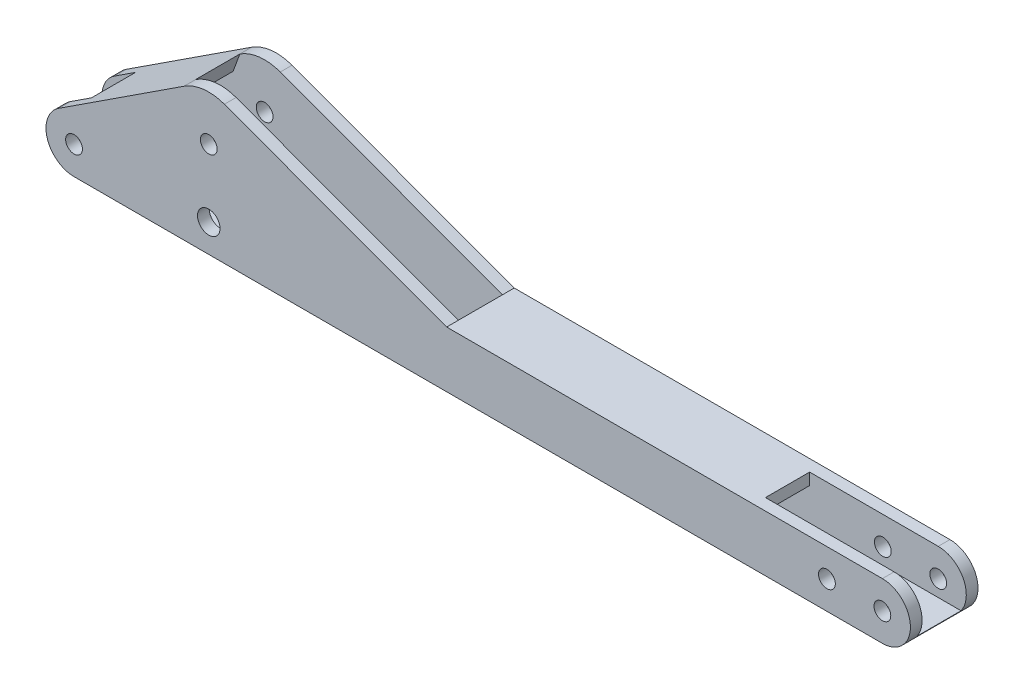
from build123d import *

# Parameters (mm, degrees)
SKETCH1_R           = 51
SKETCH1_R_2         = 38
BOSS_EXTRUDE1_DEPTH = 153
CUT_EXTRUDE1_DEPTH  = 100


with BuildPart() as part:
    # Sketch1 → Boss-Extrude1 (new, symmetric)
    with BuildSketch(Plane.XY):
        with BuildLine():
            Line((-112.047709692, 476.669189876), (-679.41492259, 106.351156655))
            ThreePointArc((-679.41492259, 106.351156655), (-731.728379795, -36.210517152), (-610, -127))
            Line((-610, -127), (3050, -127))
            ThreePointArc((3050, -127), (3177, 0), (3050, 127))
            Line((3050, 127), (1077.108170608, 127))
            Line((1077.108170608, 127), (70.809139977, 497.382602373))
            ThreePointArc((70.809139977, 497.382602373), (-23.074147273, 508.697284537), (-112.047709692, 476.669189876))
        make_face()
        Circle(SKETCH1_R, mode=Mode.SUBTRACT)
        with Locations((2799, 0)):
            Circle(SKETCH1_R_2, mode=Mode.SUBTRACT)
        with Locations((-610, 0)):
            Circle(SKETCH1_R_2, mode=Mode.SUBTRACT)
        with Locations((0, 305)):
            Circle(SKETCH1_R_2, mode=Mode.SUBTRACT)
        with Locations((3050, 0)):
            Circle(SKETCH1_R_2, mode=Mode.SUBTRACT)
    extrude(amount=BOSS_EXTRUDE1_DEPTH, both=True)

    # Sketch2 → Cut-Extrude1 (cut, symmetric)
    with BuildSketch(Plane.XY):
        with BuildLine():
            Line((-112.047709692, 476.669189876), (-142.708330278, 393.366808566))
            Line((-142.708330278, 393.366808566), (-555.531567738, 123.918934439))
            Line((-555.531567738, 123.918934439), (-584.5, 168.301700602))
            Line((-584.5, 168.301700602), (-679.41492259, 106.351156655))
            ThreePointArc((-679.41492259, 106.351156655), (-731.728379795, -36.210517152), (-610, -127))
            Line((-610, -127), (-391.824965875, -127))
            Line((-391.824965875, -127), (-310.623243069, -74))
            Line((-310.623243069, -74), (3153.213371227, -74))
            ThreePointArc((3153.213371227, -74), (3162.975661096, 58.012929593), (3050, 127))
            Line((3050, 127), (2467.600770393, 127))
            Line((2467.600770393, 127), (2467.600770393, 74))
            Line((2467.600770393, 74), (1057.600770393, 74))
            Line((1057.600770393, 74), (1077.108170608, 127))
            Line((1077.108170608, 127), (70.809139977, 497.382602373))
            ThreePointArc((70.809139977, 497.382602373), (-23.074147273, 508.697284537), (-112.047709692, 476.669189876))
        make_face()
    extrude(amount=CUT_EXTRUDE1_DEPTH, both=True, mode=Mode.SUBTRACT)


solid = part.part
